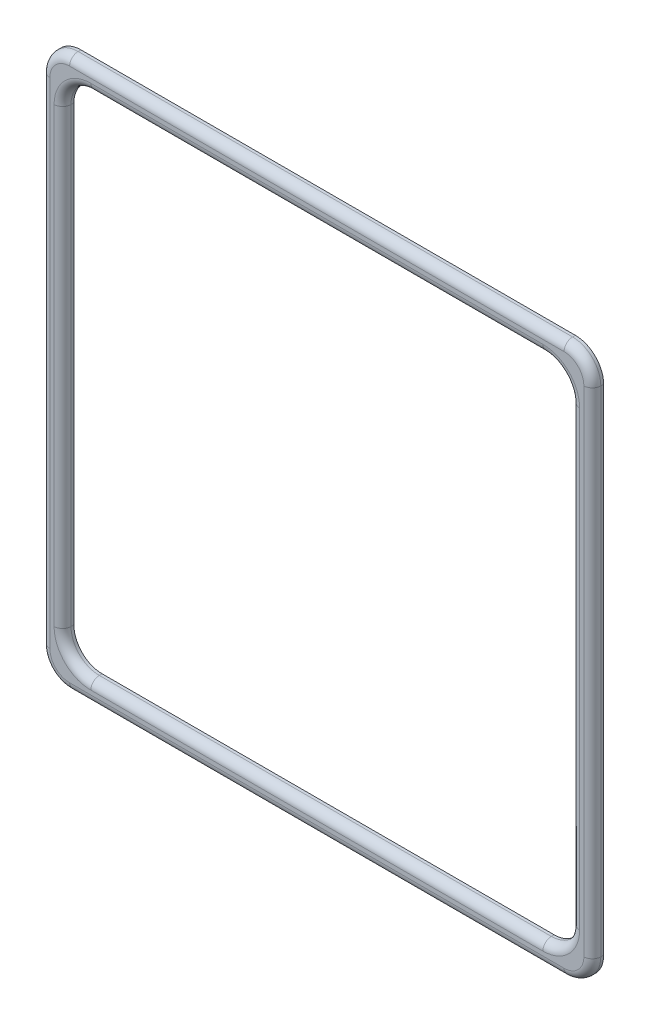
from build123d import *

# Parameters (mm, degrees)
BOSS_EXTRU_1_DEPTH = 8
CONG_2_R           = 6


with BuildPart() as part:
    # Esquisse1 → Boss.-Extru.1 (new body)
    with BuildSketch(Plane.XY):
        with BuildLine():
            Line((20, 0), (370, 0))
            ThreePointArc((370, 0), (384.142135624, 5.857864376), (390, 20))
            Line((390, 20), (390, 370))
            ThreePointArc((390, 370), (384.142135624, 384.142135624), (370, 390))
            Line((370, 390), (20, 390))
            ThreePointArc((20, 390), (5.857864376, 384.142135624), (0, 370))
            Line((0, 370), (0, 20))
            ThreePointArc((0, 20), (5.857864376, 5.857864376), (20, 0))
        make_face()
        with BuildLine():
            Line((35, 375), (355, 375))
            ThreePointArc((355, 375), (369.142135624, 369.142135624), (375, 355))
            Line((375, 355), (375, 35))
            ThreePointArc((375, 35), (369.142135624, 20.857864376), (355, 15))
            Line((355, 15), (35, 15))
            ThreePointArc((35, 15), (20.857864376, 20.857864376), (15, 35))
            Line((15, 35), (15, 355))
            ThreePointArc((15, 355), (20.857864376, 369.142135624), (35, 375))
        make_face(mode=Mode.SUBTRACT)
    extrude(amount=BOSS_EXTRU_1_DEPTH)

    # Cong_2
    cong_2_edges = [part.edges().sort_by_distance(p)[0] for p in [
        (5.857864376, 5.857864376, 8),
        (195, 0, 8),
        (384.142135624, 5.857864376, 8),
        (390, 195, 8),
        (384.142135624, 384.142135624, 8),
        (20.857864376, 20.857864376, 8),
        (195, 15, 8),
        (369.142135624, 20.857864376, 8),
        (375, 195, 8),
        (369.142135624, 369.142135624, 8),
        (195, 375, 8),
        (20.857864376, 369.142135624, 8),
        (195, 390, 8),
        (15, 195, 8),
        (5.857864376, 384.142135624, 8),
        (0, 195, 8),
    ]]
    fillet(cong_2_edges, radius=CONG_2_R)


solid = part.part
